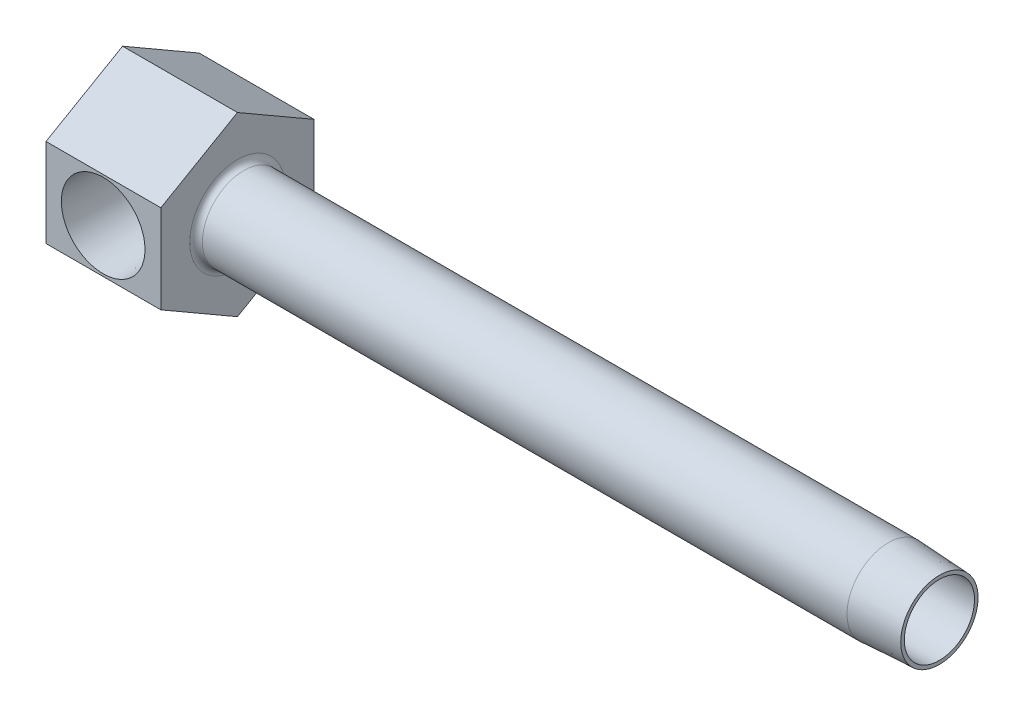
ISO-10303-21;
HEADER;
FILE_DESCRIPTION(('STEP AP214'),'2;1');
FILE_NAME('part.step','',(''),(''),'','','');
FILE_SCHEMA(('AUTOMOTIVE_DESIGN { 1 0 10303 214 1 1 1 1 }'));
ENDSEC;
DATA;
#1=APPLICATION_CONTEXT('core data for automotive mechanical design processes');
#2=APPLICATION_PROTOCOL_DEFINITION('international standard','automotive_design',2000,#1);
#3=PRODUCT_CONTEXT('',#1,'mechanical');
#4=PRODUCT('Part','Part','',(#3));
#5=PRODUCT_RELATED_PRODUCT_CATEGORY('part','',(#4));
#6=PRODUCT_DEFINITION_FORMATION('','',#4);
#7=PRODUCT_DEFINITION_CONTEXT('part definition',#1,'design');
#8=PRODUCT_DEFINITION('design','',#6,#7);
#9=PRODUCT_DEFINITION_SHAPE('','',#8);
#10=(LENGTH_UNIT() NAMED_UNIT(*) SI_UNIT(.MILLI.,.METRE.));
#11=(NAMED_UNIT(*) PLANE_ANGLE_UNIT() SI_UNIT($,.RADIAN.));
#12=(NAMED_UNIT(*) SI_UNIT($,.STERADIAN.) SOLID_ANGLE_UNIT());
#13=UNCERTAINTY_MEASURE_WITH_UNIT(LENGTH_MEASURE(1.E-05),#10,'distance_accuracy_value','');
#14=(GEOMETRIC_REPRESENTATION_CONTEXT(3) GLOBAL_UNCERTAINTY_ASSIGNED_CONTEXT((#13)) GLOBAL_UNIT_ASSIGNED_CONTEXT((#10,
#11,#12)) REPRESENTATION_CONTEXT('',''));
#15=CARTESIAN_POINT('',(0.,0.,0.));
#16=DIRECTION('',(0.,0.,1.));
#17=DIRECTION('',(1.,0.,0.));
#18=AXIS2_PLACEMENT_3D('',#15,#16,#17);
#19=CARTESIAN_POINT('',(7.14375,0.,9.525));
#20=DIRECTION('',(1.,0.,0.));
#21=DIRECTION('',(0.,0.,-1.));
#22=AXIS2_PLACEMENT_3D('',#19,#20,#21);
#23=PLANE('',#22);
#24=DIRECTION('',(0.,0.,1.));
#25=VECTOR('',#24,1.);
#26=CARTESIAN_POINT('',(7.14375,4.21628045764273,19.05));
#27=LINE('',#26,#25);
#28=CARTESIAN_POINT('',(7.14375,4.21628045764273,8.39289543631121));
#29=VERTEX_POINT('',#28);
#30=CARTESIAN_POINT('',(7.14375,4.21628045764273,10.16));
#31=VERTEX_POINT('',#30);
#32=EDGE_CURVE('E280',#29,#31,#27,.T.);
#33=ORIENTED_EDGE('',*,*,#32,.F.);
#34=CARTESIAN_POINT('',(7.14375,0.,9.525));
#35=DIRECTION('',(1.,0.,0.));
#36=DIRECTION('',(0.,0.,-1.));
#37=AXIS2_PLACEMENT_3D('',#34,#35,#36);
#38=CIRCLE('',#37,4.365625);
#39=CARTESIAN_POINT('',(7.14375,4.31919629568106,10.16));
#40=VERTEX_POINT('',#39);
#41=EDGE_CURVE('E163',#29,#40,#38,.T.);
#42=ORIENTED_EDGE('',*,*,#41,.T.);
#43=DIRECTION('',(0.,1.,0.));
#44=VECTOR('',#43,1.);
#45=CARTESIAN_POINT('',(7.14375,0.,10.16));
#46=LINE('',#45,#44);
#47=EDGE_CURVE('E153',#31,#40,#46,.T.);
#48=ORIENTED_EDGE('',*,*,#47,.F.);
#49=EDGE_LOOP('',(#33,#42,#48));
#50=FACE_BOUND('',#49,.T.);
#51=ADVANCED_FACE('F15',(#50),#23,.T.);
#52=CARTESIAN_POINT('',(14.2875,5.4992613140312,19.05));
#53=DIRECTION('',(0.,0.,-1.));
#54=DIRECTION('',(-1.,0.,0.));
#55=AXIS2_PLACEMENT_3D('',#52,#53,#54);
#56=PLANE('',#55);
#57=CARTESIAN_POINT('',(7.112,0.,19.05));
#58=DIRECTION('',(0.,0.,1.));
#59=DIRECTION('',(1.,0.,0.));
#60=AXIS2_PLACEMENT_3D('',#57,#58,#59);
#61=CIRCLE('',#60,5.2023645);
#62=CARTESIAN_POINT('',(12.3143645,0.,19.05));
#63=VERTEX_POINT('',#62);
#64=EDGE_CURVE('E269',#63,#63,#61,.T.);
#65=ORIENTED_EDGE('',*,*,#64,.F.);
#66=EDGE_LOOP('',(#65));
#67=FACE_BOUND('',#66,.T.);
#68=DIRECTION('',(0.,-1.,0.));
#69=VECTOR('',#68,1.);
#70=CARTESIAN_POINT('',(0.,5.4992613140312,19.05));
#71=LINE('',#70,#69);
#72=CARTESIAN_POINT('',(0.,5.4992613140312,19.05));
#73=VERTEX_POINT('',#72);
#74=CARTESIAN_POINT('',(0.,-5.49926131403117,19.05));
#75=VERTEX_POINT('',#74);
#76=EDGE_CURVE('E178',#73,#75,#71,.T.);
#77=ORIENTED_EDGE('',*,*,#76,.T.);
#78=DIRECTION('',(-1.,0.,0.));
#79=VECTOR('',#78,1.);
#80=CARTESIAN_POINT('',(14.2875,-5.49926131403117,19.05));
#81=LINE('',#80,#79);
#82=CARTESIAN_POINT('',(14.2875,-5.49926131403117,19.05));
#83=VERTEX_POINT('',#82);
#84=EDGE_CURVE('E201',#83,#75,#81,.T.);
#85=ORIENTED_EDGE('',*,*,#84,.F.);
#86=DIRECTION('',(0.,-1.,0.));
#87=VECTOR('',#86,1.);
#88=CARTESIAN_POINT('',(14.2875,5.4992613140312,19.05));
#89=LINE('',#88,#87);
#90=CARTESIAN_POINT('',(14.2875,5.4992613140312,19.05));
#91=VERTEX_POINT('',#90);
#92=EDGE_CURVE('E194',#91,#83,#89,.T.);
#93=ORIENTED_EDGE('',*,*,#92,.F.);
#94=DIRECTION('',(-1.,0.,0.));
#95=VECTOR('',#94,1.);
#96=CARTESIAN_POINT('',(14.2875,5.4992613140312,19.05));
#97=LINE('',#96,#95);
#98=EDGE_CURVE('E204',#91,#73,#97,.T.);
#99=ORIENTED_EDGE('',*,*,#98,.T.);
#100=EDGE_LOOP('',(#77,#85,#93,#99));
#101=FACE_BOUND('',#100,.T.);
#102=ADVANCED_FACE('F119',(#67,#101),#56,.F.);
#103=CARTESIAN_POINT('',(14.2875,-5.49926131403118,0.));
#104=DIRECTION('',(1.,0.,0.));
#105=DIRECTION('',(0.,1.,0.));
#106=AXIS2_PLACEMENT_3D('',#103,#104,#105);
#107=PLANE('',#106);
#108=CARTESIAN_POINT('',(14.2875,0.,9.525));
#109=DIRECTION('',(1.,0.,0.));
#110=DIRECTION('',(0.,1.,0.));
#111=AXIS2_PLACEMENT_3D('',#108,#109,#110);
#112=CIRCLE('',#111,5.9309);
#113=CARTESIAN_POINT('',(14.2875,5.9309,9.525));
#114=VERTEX_POINT('',#113);
#115=EDGE_CURVE('E216',#114,#114,#112,.F.);
#116=ORIENTED_EDGE('',*,*,#115,.T.);
#117=EDGE_LOOP('',(#116));
#118=FACE_BOUND('',#117,.T.);
#119=DIRECTION('',(0.,0.5,-0.866025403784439));
#120=VECTOR('',#119,1.);
#121=CARTESIAN_POINT('',(14.2875,-10.9985226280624,9.525));
#122=LINE('',#121,#120);
#123=CARTESIAN_POINT('',(14.2875,-10.9985226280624,9.525));
#124=VERTEX_POINT('',#123);
#125=CARTESIAN_POINT('',(14.2875,-5.49926131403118,0.));
#126=VERTEX_POINT('',#125);
#127=EDGE_CURVE('E184',#124,#126,#122,.T.);
#128=ORIENTED_EDGE('',*,*,#127,.T.);
#129=DIRECTION('',(0.,1.,0.));
#130=VECTOR('',#129,1.);
#131=CARTESIAN_POINT('',(14.2875,-5.49926131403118,0.));
#132=LINE('',#131,#130);
#133=CARTESIAN_POINT('',(14.2875,5.49926131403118,0.));
#134=VERTEX_POINT('',#133);
#135=EDGE_CURVE('E188',#126,#134,#132,.T.);
#136=ORIENTED_EDGE('',*,*,#135,.T.);
#137=DIRECTION('',(0.,0.5,0.866025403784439));
#138=VECTOR('',#137,1.);
#139=CARTESIAN_POINT('',(14.2875,5.49926131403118,0.));
#140=LINE('',#139,#138);
#141=CARTESIAN_POINT('',(14.2875,10.9985226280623,9.525));
#142=VERTEX_POINT('',#141);
#143=EDGE_CURVE('E190',#134,#142,#140,.T.);
#144=ORIENTED_EDGE('',*,*,#143,.T.);
#145=DIRECTION('',(0.,-0.5,0.86602540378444));
#146=VECTOR('',#145,1.);
#147=CARTESIAN_POINT('',(14.2875,10.9985226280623,9.525));
#148=LINE('',#147,#146);
#149=EDGE_CURVE('E192',#142,#91,#148,.T.);
#150=ORIENTED_EDGE('',*,*,#149,.T.);
#151=ORIENTED_EDGE('',*,*,#92,.T.);
#152=DIRECTION('',(0.,-0.5,-0.866025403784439));
#153=VECTOR('',#152,1.);
#154=CARTESIAN_POINT('',(14.2875,-5.49926131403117,19.05));
#155=LINE('',#154,#153);
#156=EDGE_CURVE('E38',#83,#124,#155,.T.);
#157=ORIENTED_EDGE('',*,*,#156,.T.);
#158=EDGE_LOOP('',(#128,#136,#144,#150,#151,#157));
#159=FACE_BOUND('',#158,.T.);
#160=ADVANCED_FACE('F127',(#118,#159),#107,.T.);
#161=CARTESIAN_POINT('',(14.2875,-10.9985226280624,9.525));
#162=DIRECTION('',(0.,0.866025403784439,0.5));
#163=DIRECTION('',(0.,-0.5,0.866025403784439));
#164=AXIS2_PLACEMENT_3D('',#161,#162,#163);
#165=PLANE('',#164);
#166=DIRECTION('',(0.,0.5,-0.866025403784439));
#167=VECTOR('',#166,1.);
#168=CARTESIAN_POINT('',(0.,-10.9985226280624,9.525));
#169=LINE('',#168,#167);
#170=CARTESIAN_POINT('',(0.,-10.9985226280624,9.525));
#171=VERTEX_POINT('',#170);
#172=CARTESIAN_POINT('',(0.,-5.49926131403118,0.));
#173=VERTEX_POINT('',#172);
#174=EDGE_CURVE('E166',#171,#173,#169,.T.);
#175=ORIENTED_EDGE('',*,*,#174,.T.);
#176=DIRECTION('',(-1.,0.,0.));
#177=VECTOR('',#176,1.);
#178=CARTESIAN_POINT('',(14.2875,-5.49926131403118,0.));
#179=LINE('',#178,#177);
#180=EDGE_CURVE('E213',#126,#173,#179,.T.);
#181=ORIENTED_EDGE('',*,*,#180,.F.);
#182=ORIENTED_EDGE('',*,*,#127,.F.);
#183=DIRECTION('',(-1.,0.,0.));
#184=VECTOR('',#183,1.);
#185=CARTESIAN_POINT('',(14.2875,-10.9985226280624,9.525));
#186=LINE('',#185,#184);
#187=EDGE_CURVE('E197',#124,#171,#186,.T.);
#188=ORIENTED_EDGE('',*,*,#187,.T.);
#189=EDGE_LOOP('',(#175,#181,#182,#188));
#190=FACE_BOUND('',#189,.T.);
#191=ADVANCED_FACE('F301',(#190),#165,.F.);
#192=CARTESIAN_POINT('',(14.2875,-5.49926131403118,0.));
#193=DIRECTION('',(0.,0.,1.));
#194=DIRECTION('',(0.,-1.,0.));
#195=AXIS2_PLACEMENT_3D('',#192,#193,#194);
#196=PLANE('',#195);
#197=DIRECTION('',(0.,1.,0.));
#198=VECTOR('',#197,1.);
#199=CARTESIAN_POINT('',(0.,-5.49926131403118,0.));
#200=LINE('',#199,#198);
#201=CARTESIAN_POINT('',(0.,5.49926131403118,0.));
#202=VERTEX_POINT('',#201);
#203=EDGE_CURVE('E169',#173,#202,#200,.T.);
#204=ORIENTED_EDGE('',*,*,#203,.T.);
#205=DIRECTION('',(-1.,0.,0.));
#206=VECTOR('',#205,1.);
#207=CARTESIAN_POINT('',(14.2875,5.49926131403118,0.));
#208=LINE('',#207,#206);
#209=EDGE_CURVE('E210',#134,#202,#208,.T.);
#210=ORIENTED_EDGE('',*,*,#209,.F.);
#211=ORIENTED_EDGE('',*,*,#135,.F.);
#212=ORIENTED_EDGE('',*,*,#180,.T.);
#213=EDGE_LOOP('',(#204,#210,#211,#212));
#214=FACE_BOUND('',#213,.T.);
#215=ADVANCED_FACE('F307',(#214),#196,.F.);
#216=CARTESIAN_POINT('',(14.2875,5.49926131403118,0.));
#217=DIRECTION('',(0.,-0.866025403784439,0.5));
#218=DIRECTION('',(0.,-0.5,-0.866025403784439));
#219=AXIS2_PLACEMENT_3D('',#216,#217,#218);
#220=PLANE('',#219);
#221=DIRECTION('',(0.,0.5,0.866025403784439));
#222=VECTOR('',#221,1.);
#223=CARTESIAN_POINT('',(0.,5.49926131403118,0.));
#224=LINE('',#223,#222);
#225=CARTESIAN_POINT('',(0.,10.9985226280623,9.525));
#226=VERTEX_POINT('',#225);
#227=EDGE_CURVE('E172',#202,#226,#224,.T.);
#228=ORIENTED_EDGE('',*,*,#227,.T.);
#229=DIRECTION('',(-1.,0.,0.));
#230=VECTOR('',#229,1.);
#231=CARTESIAN_POINT('',(14.2875,10.9985226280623,9.525));
#232=LINE('',#231,#230);
#233=EDGE_CURVE('E207',#142,#226,#232,.T.);
#234=ORIENTED_EDGE('',*,*,#233,.F.);
#235=ORIENTED_EDGE('',*,*,#143,.F.);
#236=ORIENTED_EDGE('',*,*,#209,.T.);
#237=EDGE_LOOP('',(#228,#234,#235,#236));
#238=FACE_BOUND('',#237,.T.);
#239=ADVANCED_FACE('F309',(#238),#220,.F.);
#240=CARTESIAN_POINT('',(14.2875,10.9985226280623,9.525));
#241=DIRECTION('',(0.,-0.86602540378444,-0.5));
#242=DIRECTION('',(0.,0.5,-0.86602540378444));
#243=AXIS2_PLACEMENT_3D('',#240,#241,#242);
#244=PLANE('',#243);
#245=DIRECTION('',(0.,-0.5,0.86602540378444));
#246=VECTOR('',#245,1.);
#247=CARTESIAN_POINT('',(0.,10.9985226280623,9.525));
#248=LINE('',#247,#246);
#249=EDGE_CURVE('E175',#226,#73,#248,.T.);
#250=ORIENTED_EDGE('',*,*,#249,.T.);
#251=ORIENTED_EDGE('',*,*,#98,.F.);
#252=ORIENTED_EDGE('',*,*,#149,.F.);
#253=ORIENTED_EDGE('',*,*,#233,.T.);
#254=EDGE_LOOP('',(#250,#251,#252,#253));
#255=FACE_BOUND('',#254,.T.);
#256=ADVANCED_FACE('F312',(#255),#244,.F.);
#257=CARTESIAN_POINT('',(14.2875,-5.49926131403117,19.05));
#258=DIRECTION('',(0.,0.866025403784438,-0.5));
#259=DIRECTION('',(0.,0.5,0.866025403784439));
#260=AXIS2_PLACEMENT_3D('',#257,#258,#259);
#261=PLANE('',#260);
#262=DIRECTION('',(0.,-0.5,-0.866025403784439));
#263=VECTOR('',#262,1.);
#264=CARTESIAN_POINT('',(0.,-5.49926131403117,19.05));
#265=LINE('',#264,#263);
#266=EDGE_CURVE('E181',#75,#171,#265,.T.);
#267=ORIENTED_EDGE('',*,*,#266,.T.);
#268=ORIENTED_EDGE('',*,*,#187,.F.);
#269=ORIENTED_EDGE('',*,*,#156,.F.);
#270=ORIENTED_EDGE('',*,*,#84,.T.);
#271=EDGE_LOOP('',(#267,#268,#269,#270));
#272=FACE_BOUND('',#271,.T.);
#273=ADVANCED_FACE('F296',(#272),#261,.F.);
#274=CARTESIAN_POINT('',(0.,-5.49926131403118,0.));
#275=DIRECTION('',(1.,0.,0.));
#276=DIRECTION('',(0.,1.,0.));
#277=AXIS2_PLACEMENT_3D('',#274,#275,#276);
#278=PLANE('',#277);
#279=ORIENTED_EDGE('',*,*,#174,.F.);
#280=ORIENTED_EDGE('',*,*,#266,.F.);
#281=ORIENTED_EDGE('',*,*,#76,.F.);
#282=ORIENTED_EDGE('',*,*,#249,.F.);
#283=ORIENTED_EDGE('',*,*,#227,.F.);
#284=ORIENTED_EDGE('',*,*,#203,.F.);
#285=EDGE_LOOP('',(#279,#280,#281,#282,#283,#284));
#286=FACE_BOUND('',#285,.T.);
#287=ADVANCED_FACE('F141',(#286),#278,.F.);
#288=CARTESIAN_POINT('',(68.0114010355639,0.,9.525));
#289=DIRECTION('',(-1.,0.,0.));
#290=DIRECTION('',(0.,0.,1.));
#291=AXIS2_PLACEMENT_3D('',#288,#289,#290);
#292=CYLINDRICAL_SURFACE('',#291,5.1435);
#293=CARTESIAN_POINT('',(95.25,0.,9.525));
#294=DIRECTION('',(-1.,0.,0.));
#295=DIRECTION('',(0.,0.,1.));
#296=AXIS2_PLACEMENT_3D('',#293,#294,#295);
#297=CIRCLE('',#296,5.1435);
#298=CARTESIAN_POINT('',(95.25,0.,14.6685));
#299=VERTEX_POINT('',#298);
#300=EDGE_CURVE('E10',#299,#299,#297,.F.);
#301=ORIENTED_EDGE('',*,*,#300,.F.);
#302=EDGE_LOOP('',(#301));
#303=FACE_BOUND('',#302,.T.);
#304=CARTESIAN_POINT('',(15.0749,0.,9.525));
#305=DIRECTION('',(1.,0.,0.));
#306=DIRECTION('',(0.,1.,0.));
#307=AXIS2_PLACEMENT_3D('',#304,#305,#306);
#308=CIRCLE('',#307,5.1435);
#309=CARTESIAN_POINT('',(15.0749,5.1435,9.525));
#310=VERTEX_POINT('',#309);
#311=EDGE_CURVE('E219',#310,#310,#308,.T.);
#312=ORIENTED_EDGE('',*,*,#311,.T.);
#313=EDGE_LOOP('',(#312));
#314=FACE_BOUND('',#313,.T.);
#315=ADVANCED_FACE('F17',(#303,#314),#292,.T.);
#316=CARTESIAN_POINT('',(7.14375,-4.31919629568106,10.16));
#317=VERTEX_POINT('',#316);
#318=CARTESIAN_POINT('',(7.14375,-4.21628045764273,10.16));
#319=VERTEX_POINT('',#318);
#320=EDGE_CURVE('E146',#317,#319,#46,.T.);
#321=ORIENTED_EDGE('',*,*,#320,.F.);
#322=CARTESIAN_POINT('',(7.14375,-4.21628045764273,8.39289543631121));
#323=VERTEX_POINT('',#322);
#324=EDGE_CURVE('E148',#317,#323,#38,.T.);
#325=ORIENTED_EDGE('',*,*,#324,.T.);
#326=DIRECTION('',(0.,0.,1.));
#327=VECTOR('',#326,1.);
#328=CARTESIAN_POINT('',(7.14375,-4.21628045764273,19.05));
#329=LINE('',#328,#327);
#330=EDGE_CURVE('E149',#319,#323,#329,.F.);
#331=ORIENTED_EDGE('',*,*,#330,.F.);
#332=EDGE_LOOP('',(#321,#325,#331));
#333=FACE_BOUND('',#332,.T.);
#334=ADVANCED_FACE('F122',(#333),#23,.T.);
#335=CARTESIAN_POINT('',(66.1375087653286,0.,9.525));
#336=DIRECTION('',(1.,0.,0.));
#337=DIRECTION('',(0.,0.,-1.));
#338=AXIS2_PLACEMENT_3D('',#335,#336,#337);
#339=CYLINDRICAL_SURFACE('',#338,4.365625);
#340=DIRECTION('',(1.,0.,0.));
#341=VECTOR('',#340,1.);
#342=CARTESIAN_POINT('',(66.1375087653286,4.31919629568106,10.16));
#343=LINE('',#342,#341);
#344=CARTESIAN_POINT('',(9.50166012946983,4.31919629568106,10.16));
#345=VERTEX_POINT('',#344);
#346=EDGE_CURVE('E23',#40,#345,#343,.T.);
#347=ORIENTED_EDGE('',*,*,#346,.F.);
#348=ORIENTED_EDGE('',*,*,#41,.F.);
#349=CARTESIAN_POINT('',(11.0152606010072,1.5945487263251,5.461));
#350=CARTESIAN_POINT('',(10.9690910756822,1.7075595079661,5.50534166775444));
#351=CARTESIAN_POINT('',(10.9186455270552,1.81703423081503,5.55373339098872));
#352=CARTESIAN_POINT('',(10.810302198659,2.02846645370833,5.65746242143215));
#353=CARTESIAN_POINT('',(10.7524192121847,2.13043826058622,5.71278593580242));
#354=CARTESIAN_POINT('',(10.5698905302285,2.42358040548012,5.88682744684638));
#355=CARTESIAN_POINT('',(10.4356317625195,2.6037024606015,6.01432367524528));
#356=CARTESIAN_POINT('',(10.2004726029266,2.87382153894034,6.2358690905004));
#357=CARTESIAN_POINT('',(10.1051285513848,2.97281573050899,6.32528321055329));
#358=CARTESIAN_POINT('',(9.90783434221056,3.15907014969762,6.50903483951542));
#359=CARTESIAN_POINT('',(9.80588273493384,3.2463277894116,6.60337342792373));
#360=CARTESIAN_POINT('',(9.59613587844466,3.40951469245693,6.79556583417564));
#361=CARTESIAN_POINT('',(9.48833347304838,3.48542963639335,6.89342390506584));
#362=CARTESIAN_POINT('',(9.26745878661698,3.62617881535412,7.09103053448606));
#363=CARTESIAN_POINT('',(9.15438825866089,3.69101670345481,7.19077845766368));
#364=CARTESIAN_POINT('',(8.91700112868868,3.81296593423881,7.39547820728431));
#365=CARTESIAN_POINT('',(8.79240497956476,3.86952009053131,7.50043788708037));
#366=CARTESIAN_POINT('',(8.53587575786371,3.97111492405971,7.70779573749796));
#367=CARTESIAN_POINT('',(8.40392330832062,4.01612325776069,7.81018600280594));
#368=CARTESIAN_POINT('',(8.16304729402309,4.0847277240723,7.98226690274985));
#369=CARTESIAN_POINT('',(8.0562781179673,4.11086974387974,8.05387458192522));
#370=CARTESIAN_POINT('',(7.89027521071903,4.14432560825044,8.15224503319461));
#371=CARTESIAN_POINT('',(7.83425575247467,4.15448196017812,8.18339689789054));
#372=CARTESIAN_POINT('',(7.71975817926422,4.17277321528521,8.24142733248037));
#373=CARTESIAN_POINT('',(7.6612817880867,4.18090950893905,8.26830883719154));
#374=CARTESIAN_POINT('',(7.52931857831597,4.19631734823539,8.32062856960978));
#375=CARTESIAN_POINT('',(7.45518069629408,4.2030846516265,8.34468558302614));
#376=CARTESIAN_POINT('',(7.30234246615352,4.21282137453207,8.37996487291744));
#377=CARTESIAN_POINT('',(7.22358315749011,4.21571837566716,8.39094201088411));
#378=CARTESIAN_POINT('',(7.14374999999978,4.21628045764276,8.39289543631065));
#379=B_SPLINE_CURVE_WITH_KNOTS('',3,(#349,#350,#351,#352,#353,#354,#355,#356,#357,#358,#359,
#360,#361,#362,#363,#364,#365,#366,#367,#368,#369,#370,#371,#372,#373,#374,#375,#376,#377,#378),
.UNSPECIFIED.,.F.,.F.,(4,2,2,2,2,2,2,2,2,2,2,2,2,2,4),(0.,0.389178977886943,0.777595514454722,
1.54850925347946,2.03989074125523,2.5313804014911,3.02348538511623,3.51542776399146,
4.03226982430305,4.5505442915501,4.94339994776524,5.13792303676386,5.33231185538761,
5.56585330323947,5.80370611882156),.UNSPECIFIED.);
#380=CARTESIAN_POINT('',(11.0152606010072,1.5945487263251,5.461));
#381=VERTEX_POINT('',#380);
#382=EDGE_CURVE('E222',#381,#29,#379,.T.);
#383=ORIENTED_EDGE('',*,*,#382,.F.);
#384=CARTESIAN_POINT('',(11.038608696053,-1.66986531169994,5.4913625));
#385=CARTESIAN_POINT('',(11.0105354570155,-1.5831922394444,5.45544731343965));
#386=CARTESIAN_POINT('',(10.985979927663,-1.49442111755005,5.422003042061));
#387=CARTESIAN_POINT('',(10.9431209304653,-1.31365154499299,5.36062405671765));
#388=CARTESIAN_POINT('',(10.9248095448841,-1.22165734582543,5.3326823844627));
#389=CARTESIAN_POINT('',(10.8936059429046,-1.03529168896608,5.28281066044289));
#390=CARTESIAN_POINT('',(10.8807075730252,-0.94092306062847,5.26087379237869));
#391=CARTESIAN_POINT('',(10.8594086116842,-0.750424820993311,5.22325970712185));
#392=CARTESIAN_POINT('',(10.8510094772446,-0.654294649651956,5.20758451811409));
#393=CARTESIAN_POINT('',(10.8381415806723,-0.463156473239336,5.18296779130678));
#394=CARTESIAN_POINT('',(10.8335877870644,-0.368172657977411,5.1738812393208));
#395=CARTESIAN_POINT('',(10.8276558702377,-0.177678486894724,5.16194794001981));
#396=CARTESIAN_POINT('',(10.8262790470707,-0.0821679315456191,5.15910374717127));
#397=CARTESIAN_POINT('',(10.826564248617,0.108822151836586,5.15968693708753));
#398=CARTESIAN_POINT('',(10.828226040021,0.204301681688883,5.16311383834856));
#399=CARTESIAN_POINT('',(10.8347557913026,0.3946850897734,5.17620642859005));
#400=CARTESIAN_POINT('',(10.8396224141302,0.489589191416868,5.18586951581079));
#401=CARTESIAN_POINT('',(10.8530224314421,0.678329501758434,5.2113452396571));
#402=CARTESIAN_POINT('',(10.861556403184,0.772165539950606,5.22715884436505));
#403=CARTESIAN_POINT('',(10.882977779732,0.958108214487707,5.26475262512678));
#404=CARTESIAN_POINT('',(10.8958637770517,1.05021539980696,5.28653087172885));
#405=CARTESIAN_POINT('',(10.9268394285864,1.23213175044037,5.33579934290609));
#406=CARTESIAN_POINT('',(10.9449350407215,1.32193815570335,5.36329609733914));
#407=CARTESIAN_POINT('',(10.9870994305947,1.49845562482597,5.42352620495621));
#408=CARTESIAN_POINT('',(11.0111754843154,1.58516276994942,5.45626591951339));
#409=CARTESIAN_POINT('',(11.038608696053,1.66986531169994,5.4913625));
#410=B_SPLINE_CURVE_WITH_KNOTS('',3,(#384,#385,#386,#387,#388,#389,#390,#391,#392,#393,#394,
#395,#396,#397,#398,#399,#400,#401,#402,#403,#404,#405,#406,#407,#408,#409),.UNSPECIFIED.,.F.,
.F.,(4,2,2,2,2,2,2,2,2,2,2,2,4),(0.,0.293591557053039,0.586809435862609,0.879693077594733,
1.17267150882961,1.45898777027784,1.74542117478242,2.03183258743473,2.31812458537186,
2.60446166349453,2.89070622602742,3.17727945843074,3.46420306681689),.UNSPECIFIED.);
#411=CARTESIAN_POINT('',(11.0152606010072,-1.5945487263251,5.461));
#412=VERTEX_POINT('',#411);
#413=EDGE_CURVE('E227',#412,#381,#410,.T.);
#414=ORIENTED_EDGE('',*,*,#413,.F.);
#415=CARTESIAN_POINT('',(7.14375,-4.21628045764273,8.39289543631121));
#416=CARTESIAN_POINT('',(7.18362399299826,-4.21598583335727,8.39181806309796));
#417=CARTESIAN_POINT('',(7.22338201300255,-4.21511517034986,8.38855660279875));
#418=CARTESIAN_POINT('',(7.30220974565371,-4.21229002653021,8.3781194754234));
#419=CARTESIAN_POINT('',(7.34128135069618,-4.21033927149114,8.37095726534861));
#420=CARTESIAN_POINT('',(7.45558593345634,-4.20306181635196,8.34463096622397));
#421=CARTESIAN_POINT('',(7.52959005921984,-4.19629141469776,8.32054287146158));
#422=CARTESIAN_POINT('',(7.67793141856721,-4.17895935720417,8.2616842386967));
#423=CARTESIAN_POINT('',(7.75200183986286,-4.16818767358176,8.22634138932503));
#424=CARTESIAN_POINT('',(7.89635080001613,-4.14345087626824,8.14945009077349));
#425=CARTESIAN_POINT('',(7.96662283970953,-4.12948049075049,8.10789143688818));
#426=CARTESIAN_POINT('',(8.10525974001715,-4.09836535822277,8.02024615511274));
#427=CARTESIAN_POINT('',(8.17357097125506,-4.08117012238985,7.97409391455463));
#428=CARTESIAN_POINT('',(8.30769836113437,-4.04390532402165,7.87936489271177));
#429=CARTESIAN_POINT('',(8.37351346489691,-4.02383456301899,7.83078710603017));
#430=CARTESIAN_POINT('',(8.57859672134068,-3.95588469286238,7.67482924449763));
#431=CARTESIAN_POINT('',(8.71418056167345,-3.90283307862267,7.56482866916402));
#432=CARTESIAN_POINT('',(8.97841531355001,-3.78358080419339,7.34346052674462));
#433=CARTESIAN_POINT('',(9.10705932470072,-3.71736735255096,7.23209172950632));
#434=CARTESIAN_POINT('',(9.35705912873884,-3.57190642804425,7.01153592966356));
#435=CARTESIAN_POINT('',(9.47845600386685,-3.49274436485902,6.90233956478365));
#436=CARTESIAN_POINT('',(9.71438396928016,-3.32067953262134,6.68762551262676));
#437=CARTESIAN_POINT('',(9.82891987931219,-3.22778657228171,6.58210526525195));
#438=CARTESIAN_POINT('',(10.0969445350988,-2.98549279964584,6.33327532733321));
#439=CARTESIAN_POINT('',(10.2465325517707,-2.82876640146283,6.19275827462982));
#440=CARTESIAN_POINT('',(10.5251240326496,-2.48539491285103,5.92944140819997));
#441=CARTESIAN_POINT('',(10.6541872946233,-2.29884003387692,5.80659022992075));
#442=CARTESIAN_POINT('',(10.815064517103,-2.01834728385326,5.65289947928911));
#443=CARTESIAN_POINT('',(10.8584525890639,-1.93670806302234,5.61137999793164));
#444=CARTESIAN_POINT('',(10.9405236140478,-1.76894321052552,5.53274400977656));
#445=CARTESIAN_POINT('',(10.9792015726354,-1.6828129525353,5.49563217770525));
#446=CARTESIAN_POINT('',(11.0152606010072,-1.5945487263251,5.461));
#447=B_SPLINE_CURVE_WITH_KNOTS('',3,(#415,#416,#417,#418,#419,#420,#421,#422,#423,#424,#425,
#426,#427,#428,#429,#430,#431,#432,#433,#434,#435,#436,#437,#438,#439,#440,#441,#442,#443,#444,
#445,#446),.UNSPECIFIED.,.F.,.F.,(4,2,2,2,2,2,2,2,2,2,2,2,2,2,2,4),(0.,0.119524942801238,
0.238640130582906,0.471907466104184,0.719716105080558,0.967936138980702,1.2204276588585,
1.47302472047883,2.01967972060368,2.56686861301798,3.1105838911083,3.65391262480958,
4.4259772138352,5.19574951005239,5.49953103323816,5.80363192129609),.UNSPECIFIED.);
#448=EDGE_CURVE('E162',#323,#412,#447,.T.);
#449=ORIENTED_EDGE('',*,*,#448,.F.);
#450=ORIENTED_EDGE('',*,*,#324,.F.);
#451=DIRECTION('',(1.,0.,0.));
#452=VECTOR('',#451,1.);
#453=CARTESIAN_POINT('',(66.1375087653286,-4.31919629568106,10.16));
#454=LINE('',#453,#452);
#455=CARTESIAN_POINT('',(9.50166012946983,-4.31919629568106,10.16));
#456=VERTEX_POINT('',#455);
#457=EDGE_CURVE('E160',#456,#317,#454,.F.);
#458=ORIENTED_EDGE('',*,*,#457,.F.);
#459=CARTESIAN_POINT('',(9.50159462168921,4.31922569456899,10.1598));
#460=CARTESIAN_POINT('',(9.52205476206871,4.31004461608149,10.2222542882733));
#461=CARTESIAN_POINT('',(9.54440879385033,4.29961032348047,10.2838517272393));
#462=CARTESIAN_POINT('',(9.592244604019,4.27639816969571,10.4052958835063));
#463=CARTESIAN_POINT('',(9.61772301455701,4.26362282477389,10.4651444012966));
#464=CARTESIAN_POINT('',(9.6977084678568,4.22211002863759,10.641720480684));
#465=CARTESIAN_POINT('',(9.75594525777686,4.19010742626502,10.7559937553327));
#466=CARTESIAN_POINT('',(9.87844694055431,4.11827910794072,10.9783012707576));
#467=CARTESIAN_POINT('',(9.94270165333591,4.07846648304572,11.0863455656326));
#468=CARTESIAN_POINT('',(10.0748723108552,3.9913538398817,11.2972300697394));
#469=CARTESIAN_POINT('',(10.1427929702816,3.94404402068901,11.4000632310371));
#470=CARTESIAN_POINT('',(10.298774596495,3.82856370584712,11.6276502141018));
#471=CARTESIAN_POINT('',(10.3873705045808,3.75819622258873,11.7509249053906));
#472=CARTESIAN_POINT('',(10.5646676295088,3.60591330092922,11.9899830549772));
#473=CARTESIAN_POINT('',(10.6533688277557,3.52399966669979,12.1057676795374));
#474=CARTESIAN_POINT('',(10.828903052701,3.34837324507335,12.3298815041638));
#475=CARTESIAN_POINT('',(10.9157338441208,3.25464716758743,12.4382020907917));
#476=CARTESIAN_POINT('',(11.0854790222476,3.05533823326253,12.6465978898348));
#477=CARTESIAN_POINT('',(11.1683947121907,2.94975936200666,12.746675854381));
#478=CARTESIAN_POINT('',(11.3637298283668,2.67738871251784,12.9797077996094));
#479=CARTESIAN_POINT('',(11.4730979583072,2.50408908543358,13.1077769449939));
#480=CARTESIAN_POINT('',(11.6736784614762,2.13317678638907,13.3402290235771));
#481=CARTESIAN_POINT('',(11.764930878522,1.93561933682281,13.444664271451));
#482=CARTESIAN_POINT('',(11.9092563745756,1.55445058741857,13.608817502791));
#483=CARTESIAN_POINT('',(11.9662034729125,1.37434002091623,13.6731460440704));
#484=CARTESIAN_POINT('',(12.036275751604,1.09545803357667,13.7520594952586));
#485=CARTESIAN_POINT('',(12.0570798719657,1.00100886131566,13.7754393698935));
#486=CARTESIAN_POINT('',(12.093196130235,0.80976989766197,13.8159777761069));
#487=CARTESIAN_POINT('',(12.1085105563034,0.712981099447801,13.8331388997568));
#488=CARTESIAN_POINT('',(12.1334016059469,0.517219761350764,13.861011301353));
#489=CARTESIAN_POINT('',(12.1429475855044,0.418238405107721,13.8716881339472));
#490=CARTESIAN_POINT('',(12.1559671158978,0.219418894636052,13.8862461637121));
#491=CARTESIAN_POINT('',(12.159443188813,0.119581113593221,13.8901301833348));
#492=CARTESIAN_POINT('',(12.1602489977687,-0.0801622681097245,13.8910308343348));
#493=CARTESIAN_POINT('',(12.157578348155,-0.180067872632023,13.8880470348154));
#494=CARTESIAN_POINT('',(12.1461610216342,-0.379063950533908,13.87528173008));
#495=CARTESIAN_POINT('',(12.1374146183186,-0.478154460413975,13.8655005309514));
#496=CARTESIAN_POINT('',(12.1041501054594,-0.757548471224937,13.8282625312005));
#497=CARTESIAN_POINT('',(12.0725539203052,-0.936048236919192,13.7928583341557));
#498=CARTESIAN_POINT('',(11.9914510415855,-1.28332325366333,13.701614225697));
#499=CARTESIAN_POINT('',(11.9419389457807,-1.45209555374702,13.645768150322));
#500=CARTESIAN_POINT('',(11.8234161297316,-1.78986703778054,13.5113020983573));
#501=CARTESIAN_POINT('',(11.7531886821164,-1.95786359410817,13.4312490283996));
#502=CARTESIAN_POINT('',(11.5990616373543,-2.2774775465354,13.2539727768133));
#503=CARTESIAN_POINT('',(11.515160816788,-2.42909347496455,13.1567480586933));
#504=CARTESIAN_POINT('',(11.2893838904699,-2.79222476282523,12.8919364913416));
#505=CARTESIAN_POINT('',(11.1405152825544,-2.99235864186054,12.7145443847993));
#506=CARTESIAN_POINT('',(10.9077049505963,-3.26312100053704,12.4281267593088));
#507=CARTESIAN_POINT('',(10.8282461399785,-3.34869576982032,12.3289140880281));
#508=CARTESIAN_POINT('',(10.6676325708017,-3.51003537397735,12.1240974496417));
#509=CARTESIAN_POINT('',(10.5864785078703,-3.58580414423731,12.0184960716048));
#510=CARTESIAN_POINT('',(10.4220303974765,-3.72941202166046,11.798300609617));
#511=CARTESIAN_POINT('',(10.338734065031,-3.79700254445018,11.6835467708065));
#512=CARTESIAN_POINT('',(10.1740816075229,-3.92201333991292,11.4470806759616));
#513=CARTESIAN_POINT('',(10.092727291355,-3.97942442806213,11.3253622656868));
#514=CARTESIAN_POINT('',(9.93568225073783,-4.08324264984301,11.0754774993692));
#515=CARTESIAN_POINT('',(9.85994825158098,-4.12974154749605,10.9473767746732));
#516=CARTESIAN_POINT('',(9.71779756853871,-4.21155620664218,10.6828322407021));
#517=CARTESIAN_POINT('',(9.65135922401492,-4.24689821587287,10.5464089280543));
#518=CARTESIAN_POINT('',(9.57628126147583,-4.28419371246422,10.3652627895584));
#519=CARTESIAN_POINT('',(9.56028735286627,-4.29194911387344,10.3247361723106));
#520=CARTESIAN_POINT('',(9.52977406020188,-4.30640007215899,10.2428664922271));
#521=CARTESIAN_POINT('',(9.51525722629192,-4.31309380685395,10.2015221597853));
#522=CARTESIAN_POINT('',(9.50159462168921,-4.31922569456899,10.1598));
#523=B_SPLINE_CURVE_WITH_KNOTS('',3,(#459,#460,#461,#462,#463,#464,#465,#466,#467,#468,#469,
#470,#471,#472,#473,#474,#475,#476,#477,#478,#479,#480,#481,#482,#483,#484,#485,#486,#487,#488,
#489,#490,#491,#492,#493,#494,#495,#496,#497,#498,#499,#500,#501,#502,#503,#504,#505,#506,#507,
#508,#509,#510,#511,#512,#513,#514,#515,#516,#517,#518,#519,#520,#521,#522),.UNSPECIFIED.,.F.,
.F.,(4,2,2,2,2,2,2,2,2,2,2,2,2,2,2,2,2,2,2,2,2,2,2,2,2,2,2,2,2,2,2,4),(0.,0.19895577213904,
0.397698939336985,0.793542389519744,1.1887279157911,1.58443438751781,2.08580736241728,
2.58710208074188,3.08896592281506,3.5906615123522,4.3128774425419,5.03347872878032,
5.62940645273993,5.92758657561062,6.22564226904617,6.52526772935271,6.82476866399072,
7.12428839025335,7.4237946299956,7.97525228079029,8.52687635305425,9.12138980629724,
9.71595648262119,10.6287987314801,11.0881817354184,11.5473798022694,12.018174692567,
12.4893922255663,12.9564924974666,13.4224855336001,13.5552077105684,13.6881552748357),.UNSPECIFIED.);
#524=EDGE_CURVE('E241',#345,#456,#523,.T.);
#525=ORIENTED_EDGE('',*,*,#524,.F.);
#526=EDGE_LOOP('',(#347,#348,#383,#414,#449,#450,#458,#525));
#527=FACE_BOUND('',#526,.T.);
#528=CARTESIAN_POINT('',(101.6,0.,9.525));
#529=DIRECTION('',(-1.,0.,0.));
#530=DIRECTION('',(0.,0.,1.));
#531=AXIS2_PLACEMENT_3D('',#528,#529,#530);
#532=CIRCLE('',#531,4.365625);
#533=CARTESIAN_POINT('',(101.6,0.,13.890625));
#534=VERTEX_POINT('',#533);
#535=EDGE_CURVE('E267',#534,#534,#532,.T.);
#536=ORIENTED_EDGE('',*,*,#535,.F.);
#537=EDGE_LOOP('',(#536));
#538=FACE_BOUND('',#537,.T.);
#539=ADVANCED_FACE('F114',(#527,#538),#339,.F.);
#540=CARTESIAN_POINT('',(15.0749,0.,9.525));
#541=DIRECTION('',(1.,0.,0.));
#542=DIRECTION('',(0.,1.,0.));
#543=AXIS2_PLACEMENT_3D('',#540,#541,#542);
#544=TOROIDAL_SURFACE('',#543,5.9309,0.7874);
#545=ORIENTED_EDGE('',*,*,#311,.F.);
#546=EDGE_LOOP('',(#545));
#547=FACE_BOUND('',#546,.T.);
#548=ORIENTED_EDGE('',*,*,#115,.F.);
#549=EDGE_LOOP('',(#548));
#550=FACE_BOUND('',#549,.T.);
#551=ADVANCED_FACE('F103',(#547,#550),#544,.F.);
#552=CARTESIAN_POINT('',(7.112,0.,5.461));
#553=DIRECTION('',(0.,0.,1.));
#554=DIRECTION('',(1.,0.,0.));
#555=AXIS2_PLACEMENT_3D('',#552,#553,#554);
#556=CONICAL_SURFACE('',#555,4.2164,1.02974425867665);
#557=ORIENTED_EDGE('',*,*,#413,.T.);
#558=CARTESIAN_POINT('',(7.112,0.,5.461));
#559=DIRECTION('',(0.,0.,1.));
#560=DIRECTION('',(1.,0.,0.));
#561=AXIS2_PLACEMENT_3D('',#558,#559,#560);
#562=CIRCLE('',#561,4.2164);
#563=EDGE_CURVE('E30',#381,#412,#562,.T.);
#564=ORIENTED_EDGE('',*,*,#563,.T.);
#565=EDGE_LOOP('',(#557,#564));
#566=FACE_BOUND('',#565,.T.);
#567=CARTESIAN_POINT('',(7.112,0.,2.92753128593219));
#568=VERTEX_POINT('',#567);
#569=VERTEX_LOOP('',#568);
#570=FACE_BOUND('',#569,.T.);
#571=ADVANCED_FACE('F100',(#566,#570),#556,.F.);
#572=CARTESIAN_POINT('',(7.112,0.,19.05));
#573=DIRECTION('',(0.,0.,1.));
#574=DIRECTION('',(1.,0.,0.));
#575=AXIS2_PLACEMENT_3D('',#572,#573,#574);
#576=CYLINDRICAL_SURFACE('',#575,4.2164);
#577=ORIENTED_EDGE('',*,*,#330,.T.);
#578=ORIENTED_EDGE('',*,*,#448,.T.);
#579=ORIENTED_EDGE('',*,*,#563,.F.);
#580=ORIENTED_EDGE('',*,*,#382,.T.);
#581=ORIENTED_EDGE('',*,*,#32,.T.);
#582=CARTESIAN_POINT('',(7.112,0.,10.16));
#583=DIRECTION('',(0.,0.,1.));
#584=DIRECTION('',(1.,0.,0.));
#585=AXIS2_PLACEMENT_3D('',#582,#583,#584);
#586=CIRCLE('',#585,4.2164);
#587=EDGE_CURVE('E277',#31,#319,#586,.T.);
#588=ORIENTED_EDGE('',*,*,#587,.T.);
#589=EDGE_LOOP('',(#577,#578,#579,#580,#581,#588));
#590=FACE_BOUND('',#589,.T.);
#591=ADVANCED_FACE('F102',(#590),#576,.F.);
#592=CARTESIAN_POINT('',(11.3284,0.,10.16));
#593=DIRECTION('',(0.,0.,-1.));
#594=DIRECTION('',(-1.,0.,0.));
#595=AXIS2_PLACEMENT_3D('',#592,#593,#594);
#596=PLANE('',#595);
#597=ORIENTED_EDGE('',*,*,#47,.T.);
#598=ORIENTED_EDGE('',*,*,#346,.T.);
#599=CARTESIAN_POINT('',(7.112,0.,10.16));
#600=DIRECTION('',(0.,0.,1.));
#601=DIRECTION('',(1.,0.,0.));
#602=AXIS2_PLACEMENT_3D('',#599,#600,#601);
#603=CIRCLE('',#602,4.93618599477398);
#604=EDGE_CURVE('E274',#345,#456,#603,.T.);
#605=ORIENTED_EDGE('',*,*,#604,.T.);
#606=ORIENTED_EDGE('',*,*,#457,.T.);
#607=ORIENTED_EDGE('',*,*,#320,.T.);
#608=ORIENTED_EDGE('',*,*,#587,.F.);
#609=EDGE_LOOP('',(#597,#598,#605,#606,#607,#608));
#610=FACE_BOUND('',#609,.T.);
#611=ADVANCED_FACE('F112',(#610),#596,.F.);
#612=CARTESIAN_POINT('',(7.112,0.,19.05));
#613=DIRECTION('',(0.,0.,1.));
#614=DIRECTION('',(1.,0.,0.));
#615=AXIS2_PLACEMENT_3D('',#612,#613,#614);
#616=CONICAL_SURFACE('',#615,5.2023645,0.0299323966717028);
#617=ORIENTED_EDGE('',*,*,#524,.T.);
#618=ORIENTED_EDGE('',*,*,#604,.F.);
#619=EDGE_LOOP('',(#617,#618));
#620=FACE_BOUND('',#619,.T.);
#621=ORIENTED_EDGE('',*,*,#64,.T.);
#622=EDGE_LOOP('',(#621));
#623=FACE_BOUND('',#622,.T.);
#624=ADVANCED_FACE('F246',(#620,#623),#616,.F.);
#625=CARTESIAN_POINT('',(101.6,0.,9.525));
#626=DIRECTION('',(-1.,0.,0.));
#627=DIRECTION('',(0.,0.,1.));
#628=AXIS2_PLACEMENT_3D('',#625,#626,#627);
#629=CONICAL_SURFACE('',#628,4.81071060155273,0.052359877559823);
#630=ORIENTED_EDGE('',*,*,#300,.T.);
#631=EDGE_LOOP('',(#630));
#632=FACE_BOUND('',#631,.T.);
#633=CARTESIAN_POINT('',(101.6,0.,9.525));
#634=DIRECTION('',(-1.,0.,0.));
#635=DIRECTION('',(0.,0.,1.));
#636=AXIS2_PLACEMENT_3D('',#633,#634,#635);
#637=CIRCLE('',#636,4.81071060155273);
#638=CARTESIAN_POINT('',(101.6,0.,14.3357106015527));
#639=VERTEX_POINT('',#638);
#640=EDGE_CURVE('E264',#639,#639,#637,.T.);
#641=ORIENTED_EDGE('',*,*,#640,.T.);
#642=EDGE_LOOP('',(#641));
#643=FACE_BOUND('',#642,.T.);
#644=ADVANCED_FACE('F250',(#632,#643),#629,.T.);
#645=CARTESIAN_POINT('',(101.6,0.,5.159375));
#646=DIRECTION('',(-1.,0.,0.));
#647=DIRECTION('',(0.,0.,1.));
#648=AXIS2_PLACEMENT_3D('',#645,#646,#647);
#649=PLANE('',#648);
#650=ORIENTED_EDGE('',*,*,#640,.F.);
#651=EDGE_LOOP('',(#650));
#652=FACE_BOUND('',#651,.T.);
#653=ORIENTED_EDGE('',*,*,#535,.T.);
#654=EDGE_LOOP('',(#653));
#655=FACE_BOUND('',#654,.T.);
#656=ADVANCED_FACE('F254',(#652,#655),#649,.F.);
#657=CLOSED_SHELL('',(#51,#102,#160,#191,#215,#239,#256,#273,#287,#315,#334,#539,#551,#571,#591,
#611,#624,#644,#656));
#658=MANIFOLD_SOLID_BREP('B1',#657);
#659=ADVANCED_BREP_SHAPE_REPRESENTATION('',(#18,#658),#14);
#660=SHAPE_DEFINITION_REPRESENTATION(#9,#659);
ENDSEC;
END-ISO-10303-21;
